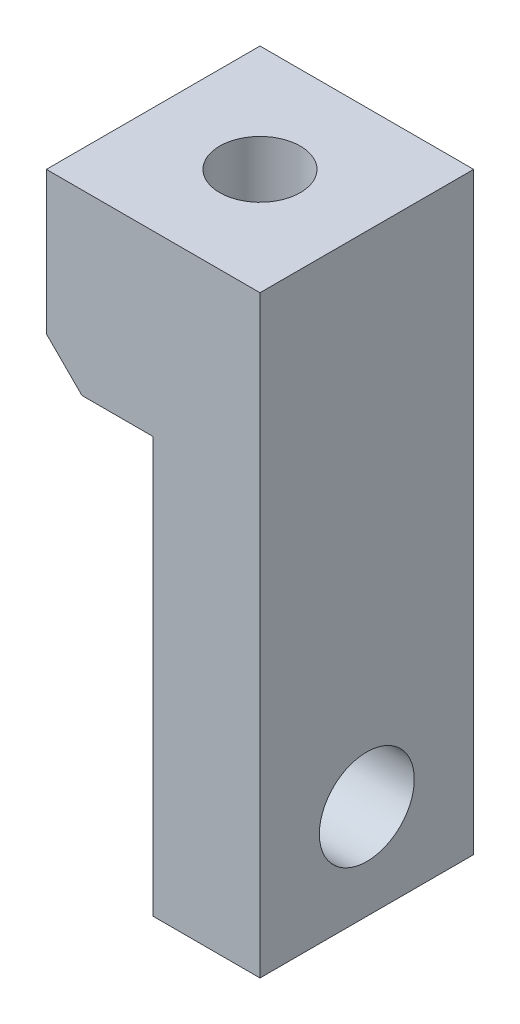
from build123d import *

# Parameters (mm, degrees)
EXTRUSION1_DEPTH        = 18
TROU_TARAUD_M81_D       = 6.8
TROU_TARAUD_M81_DEPTH   = 26
TROU_TARAUD_M81_TIP     = 2.042926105
ESQUISSE4_R             = 4
ENL_V_MAT_EXTRU_1_DEPTH = 54.898051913


with BuildPart() as part:
    # Esquisse1 → Extrusion1 (new body)
    with BuildSketch(Plane.XY):
        Polygon((0, 0), (0, 35), (-6, 35), (-9, 38), (-9, 50), (9, 50), (9, 0), align=None)
    extrude(amount=EXTRUSION1_DEPTH)

    # Trou taraud_ M81
    with Locations(Plane(origin=(0, 50, 0), x_dir=(-1, 0, 0), z_dir=(0, 1, 0))):
        with Locations((0, 9)):
            Hole(TROU_TARAUD_M81_D / 2, depth=TROU_TARAUD_M81_DEPTH)
            with Locations((0, 0, -(TROU_TARAUD_M81_DEPTH + TROU_TARAUD_M81_TIP / 2))):  # 118° drill point
                Cone(0, TROU_TARAUD_M81_D / 2, TROU_TARAUD_M81_TIP, mode=Mode.SUBTRACT)

    # Esquisse4 → Enl_v. mat.-Extru.1 (cut, through all)
    with BuildSketch(Plane.ZY):
        with Locations((9, 8)):
            Circle(ESQUISSE4_R)
    extrude(amount=-ENL_V_MAT_EXTRU_1_DEPTH, mode=Mode.SUBTRACT)


solid = part.part
